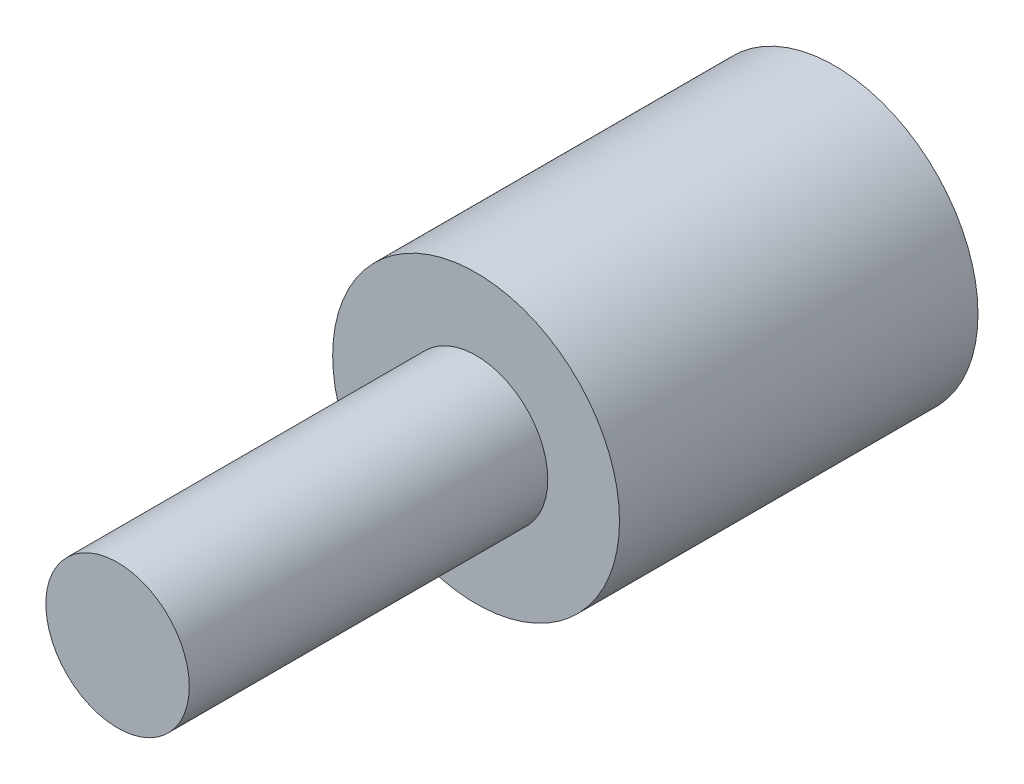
ISO-10303-21;
HEADER;
FILE_DESCRIPTION(('STEP AP214'),'2;1');
FILE_NAME('part.step','',(''),(''),'','','');
FILE_SCHEMA(('AUTOMOTIVE_DESIGN { 1 0 10303 214 1 1 1 1 }'));
ENDSEC;
DATA;
#1=APPLICATION_CONTEXT('core data for automotive mechanical design processes');
#2=APPLICATION_PROTOCOL_DEFINITION('international standard','automotive_design',2000,#1);
#3=PRODUCT_CONTEXT('',#1,'mechanical');
#4=PRODUCT('Part','Part','',(#3));
#5=PRODUCT_RELATED_PRODUCT_CATEGORY('part','',(#4));
#6=PRODUCT_DEFINITION_FORMATION('','',#4);
#7=PRODUCT_DEFINITION_CONTEXT('part definition',#1,'design');
#8=PRODUCT_DEFINITION('design','',#6,#7);
#9=PRODUCT_DEFINITION_SHAPE('','',#8);
#10=(LENGTH_UNIT() NAMED_UNIT(*) SI_UNIT(.MILLI.,.METRE.));
#11=(NAMED_UNIT(*) PLANE_ANGLE_UNIT() SI_UNIT($,.RADIAN.));
#12=(NAMED_UNIT(*) SI_UNIT($,.STERADIAN.) SOLID_ANGLE_UNIT());
#13=UNCERTAINTY_MEASURE_WITH_UNIT(LENGTH_MEASURE(1.E-05),#10,'distance_accuracy_value','');
#14=(GEOMETRIC_REPRESENTATION_CONTEXT(3) GLOBAL_UNCERTAINTY_ASSIGNED_CONTEXT((#13)) GLOBAL_UNIT_ASSIGNED_CONTEXT((#10,
#11,#12)) REPRESENTATION_CONTEXT('',''));
#15=CARTESIAN_POINT('',(0.,0.,0.));
#16=DIRECTION('',(0.,0.,1.));
#17=DIRECTION('',(1.,0.,0.));
#18=AXIS2_PLACEMENT_3D('',#15,#16,#17);
#19=CARTESIAN_POINT('',(0.,15.,0.));
#20=DIRECTION('',(0.,0.,-1.));
#21=DIRECTION('',(-1.,0.,0.));
#22=AXIS2_PLACEMENT_3D('',#19,#20,#21);
#23=PLANE('',#22);
#24=CARTESIAN_POINT('',(0.,0.,0.));
#25=DIRECTION('',(0.,0.,1.));
#26=DIRECTION('',(1.,0.,0.));
#27=AXIS2_PLACEMENT_3D('',#24,#25,#26);
#28=CIRCLE('',#27,15.);
#29=CARTESIAN_POINT('',(15.,0.,0.));
#30=VERTEX_POINT('',#29);
#31=EDGE_CURVE('E45',#30,#30,#28,.T.);
#32=ORIENTED_EDGE('',*,*,#31,.T.);
#33=EDGE_LOOP('',(#32));
#34=FACE_BOUND('',#33,.T.);
#35=ADVANCED_FACE('F31',(#34),#23,.F.);
#36=CARTESIAN_POINT('',(0.,0.,-150.));
#37=DIRECTION('',(0.,0.,1.));
#38=DIRECTION('',(1.,0.,0.));
#39=AXIS2_PLACEMENT_3D('',#36,#37,#38);
#40=PLANE('',#39);
#41=CARTESIAN_POINT('',(0.,0.,-150.));
#42=DIRECTION('',(0.,0.,-1.));
#43=DIRECTION('',(-1.,0.,0.));
#44=AXIS2_PLACEMENT_3D('',#41,#42,#43);
#45=CIRCLE('',#44,20.);
#46=CARTESIAN_POINT('',(-20.,0.,-150.));
#47=VERTEX_POINT('',#46);
#48=EDGE_CURVE('E53',#47,#47,#45,.T.);
#49=ORIENTED_EDGE('',*,*,#48,.F.);
#50=EDGE_LOOP('',(#49));
#51=FACE_BOUND('',#50,.T.);
#52=CARTESIAN_POINT('',(0.,0.,-150.));
#53=DIRECTION('',(0.,0.,1.));
#54=DIRECTION('',(1.,0.,0.));
#55=AXIS2_PLACEMENT_3D('',#52,#53,#54);
#56=CIRCLE('',#55,30.);
#57=CARTESIAN_POINT('',(30.,0.,-150.));
#58=VERTEX_POINT('',#57);
#59=EDGE_CURVE('E10',#58,#58,#56,.T.);
#60=ORIENTED_EDGE('',*,*,#59,.F.);
#61=EDGE_LOOP('',(#60));
#62=FACE_BOUND('',#61,.T.);
#63=ADVANCED_FACE('F59',(#51,#62),#40,.F.);
#64=CARTESIAN_POINT('',(0.,0.,0.));
#65=DIRECTION('',(0.,0.,1.));
#66=DIRECTION('',(1.,0.,0.));
#67=AXIS2_PLACEMENT_3D('',#64,#65,#66);
#68=CYLINDRICAL_SURFACE('',#67,30.);
#69=CARTESIAN_POINT('',(0.,0.,-75.));
#70=DIRECTION('',(0.,0.,1.));
#71=DIRECTION('',(1.,0.,0.));
#72=AXIS2_PLACEMENT_3D('',#69,#70,#71);
#73=CIRCLE('',#72,30.);
#74=CARTESIAN_POINT('',(30.,0.,-75.));
#75=VERTEX_POINT('',#74);
#76=EDGE_CURVE('E37',#75,#75,#73,.T.);
#77=ORIENTED_EDGE('',*,*,#76,.F.);
#78=EDGE_LOOP('',(#77));
#79=FACE_BOUND('',#78,.T.);
#80=ORIENTED_EDGE('',*,*,#59,.T.);
#81=EDGE_LOOP('',(#80));
#82=FACE_BOUND('',#81,.T.);
#83=ADVANCED_FACE('F62',(#79,#82),#68,.T.);
#84=CARTESIAN_POINT('',(0.,30.,-75.));
#85=DIRECTION('',(0.,0.,-1.));
#86=DIRECTION('',(-1.,0.,0.));
#87=AXIS2_PLACEMENT_3D('',#84,#85,#86);
#88=PLANE('',#87);
#89=CARTESIAN_POINT('',(0.,0.,-75.));
#90=DIRECTION('',(0.,0.,1.));
#91=DIRECTION('',(1.,0.,0.));
#92=AXIS2_PLACEMENT_3D('',#89,#90,#91);
#93=CIRCLE('',#92,15.);
#94=CARTESIAN_POINT('',(15.,0.,-75.));
#95=VERTEX_POINT('',#94);
#96=EDGE_CURVE('E41',#95,#95,#93,.T.);
#97=ORIENTED_EDGE('',*,*,#96,.F.);
#98=EDGE_LOOP('',(#97));
#99=FACE_BOUND('',#98,.T.);
#100=ORIENTED_EDGE('',*,*,#76,.T.);
#101=EDGE_LOOP('',(#100));
#102=FACE_BOUND('',#101,.T.);
#103=ADVANCED_FACE('F67',(#99,#102),#88,.F.);
#104=CARTESIAN_POINT('',(0.,0.,0.));
#105=DIRECTION('',(0.,0.,1.));
#106=DIRECTION('',(1.,0.,0.));
#107=AXIS2_PLACEMENT_3D('',#104,#105,#106);
#108=CYLINDRICAL_SURFACE('',#107,15.);
#109=ORIENTED_EDGE('',*,*,#31,.F.);
#110=EDGE_LOOP('',(#109));
#111=FACE_BOUND('',#110,.T.);
#112=ORIENTED_EDGE('',*,*,#96,.T.);
#113=EDGE_LOOP('',(#112));
#114=FACE_BOUND('',#113,.T.);
#115=ADVANCED_FACE('F74',(#111,#114),#108,.T.);
#116=CARTESIAN_POINT('',(0.,0.,-130.));
#117=DIRECTION('',(0.,0.,-1.));
#118=DIRECTION('',(-1.,0.,0.));
#119=AXIS2_PLACEMENT_3D('',#116,#117,#118);
#120=CYLINDRICAL_SURFACE('',#119,20.);
#121=CARTESIAN_POINT('',(0.,0.,-130.));
#122=DIRECTION('',(0.,0.,-1.));
#123=DIRECTION('',(-1.,0.,0.));
#124=AXIS2_PLACEMENT_3D('',#121,#122,#123);
#125=CIRCLE('',#124,20.);
#126=CARTESIAN_POINT('',(-20.,0.,-130.));
#127=VERTEX_POINT('',#126);
#128=EDGE_CURVE('E50',#127,#127,#125,.T.);
#129=ORIENTED_EDGE('',*,*,#128,.F.);
#130=EDGE_LOOP('',(#129));
#131=FACE_BOUND('',#130,.T.);
#132=ORIENTED_EDGE('',*,*,#48,.T.);
#133=EDGE_LOOP('',(#132));
#134=FACE_BOUND('',#133,.T.);
#135=ADVANCED_FACE('F57',(#131,#134),#120,.F.);
#136=CARTESIAN_POINT('',(0.,0.,-130.));
#137=DIRECTION('',(0.,0.,-1.));
#138=DIRECTION('',(-1.,0.,0.));
#139=AXIS2_PLACEMENT_3D('',#136,#137,#138);
#140=PLANE('',#139);
#141=ORIENTED_EDGE('',*,*,#128,.T.);
#142=EDGE_LOOP('',(#141));
#143=FACE_BOUND('',#142,.T.);
#144=ADVANCED_FACE('F81',(#143),#140,.T.);
#145=CLOSED_SHELL('',(#35,#63,#83,#103,#115,#135,#144));
#146=MANIFOLD_SOLID_BREP('B2',#145);
#147=ADVANCED_BREP_SHAPE_REPRESENTATION('',(#18,#146),#14);
#148=SHAPE_DEFINITION_REPRESENTATION(#9,#147);
ENDSEC;
END-ISO-10303-21;
